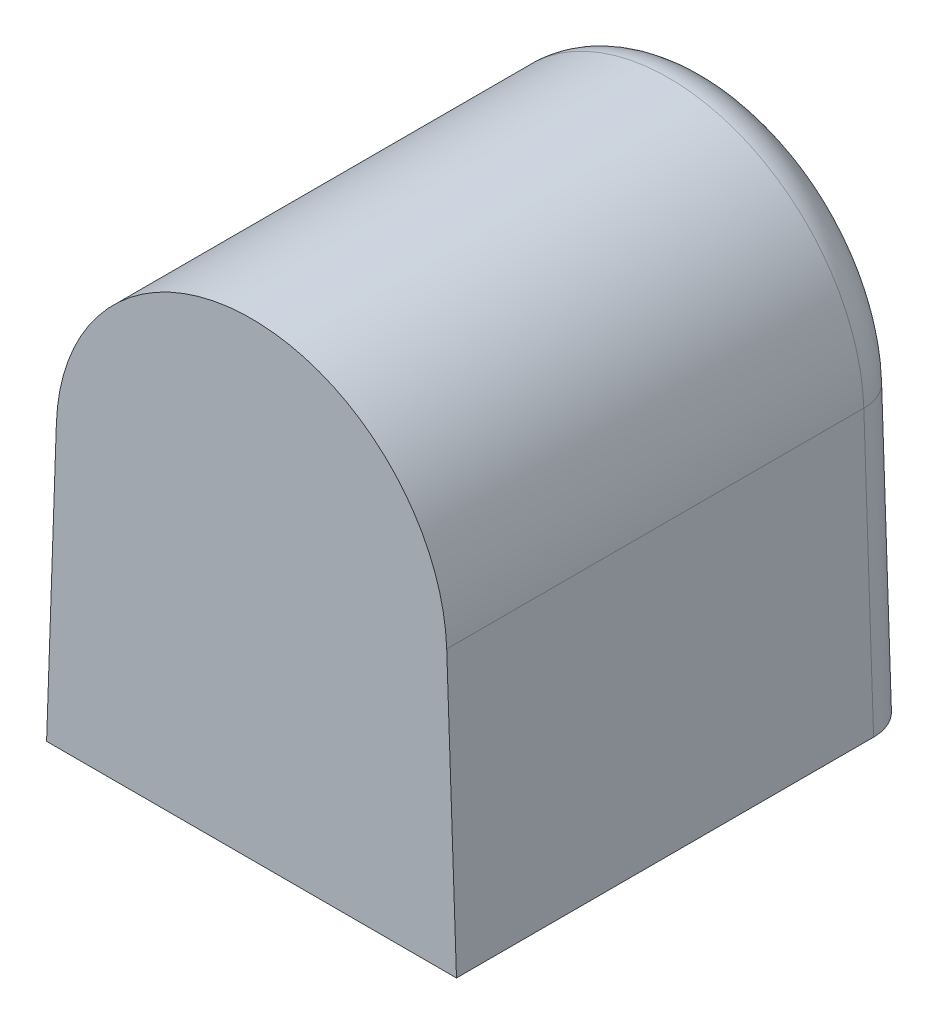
from build123d import *

# Parameters (mm, degrees)
BOSS_EXTRUDE1_DEPTH = 32
FILLET1_R           = 3


with BuildPart() as part:
    # Sketch1 → Boss-Extrude1 (new body)
    with BuildSketch(Plane.XY):
        with BuildLine():
            Line((-14.25, 0), (14.25, 0))
            Line((14.25, 0), (13.569957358, 19.473873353))
            ThreePointArc((13.569957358, 19.473873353), (0, 32.578228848), (-13.569957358, 19.473873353))
            Line((-13.569957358, 19.473873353), (-14.25, 0))
        make_face()
    extrude(amount=-BOSS_EXTRUDE1_DEPTH)

    # Fillet1
    fillet1_edges = [part.edges().sort_by_distance(p)[0] for p in [
        (-13.909978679, 9.736936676, -32),
        (13.909978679, 9.736936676, -32),
        (0, 32.578228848, -32),
    ]]
    fillet(fillet1_edges, radius=FILLET1_R)


solid = part.part
